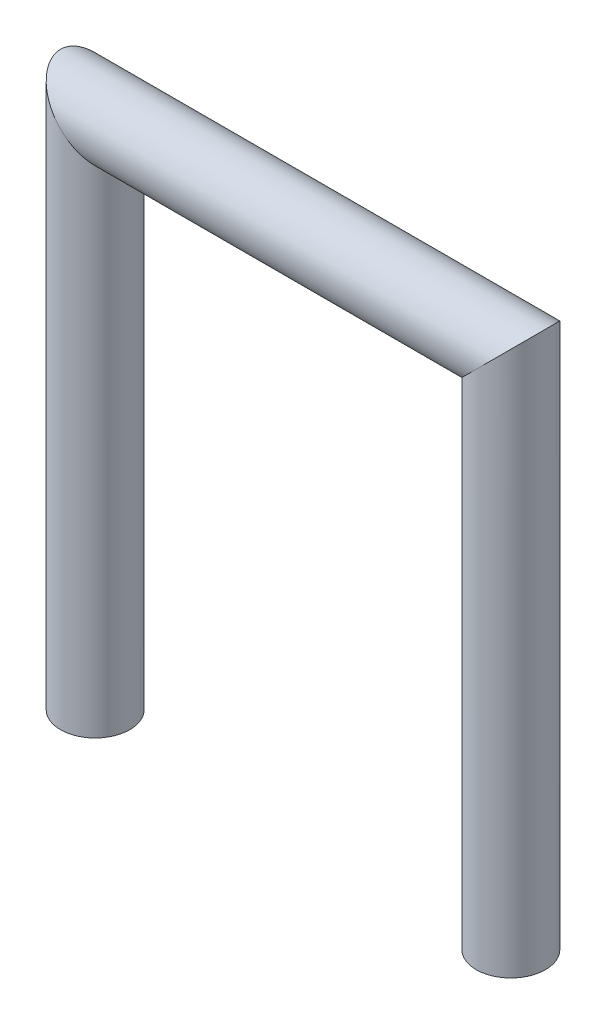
ISO-10303-21;
HEADER;
FILE_DESCRIPTION(('STEP AP214'),'2;1');
FILE_NAME('part.step','',(''),(''),'','','');
FILE_SCHEMA(('AUTOMOTIVE_DESIGN { 1 0 10303 214 1 1 1 1 }'));
ENDSEC;
DATA;
#1=APPLICATION_CONTEXT('core data for automotive mechanical design processes');
#2=APPLICATION_PROTOCOL_DEFINITION('international standard','automotive_design',2000,#1);
#3=PRODUCT_CONTEXT('',#1,'mechanical');
#4=PRODUCT('Part','Part','',(#3));
#5=PRODUCT_RELATED_PRODUCT_CATEGORY('part','',(#4));
#6=PRODUCT_DEFINITION_FORMATION('','',#4);
#7=PRODUCT_DEFINITION_CONTEXT('part definition',#1,'design');
#8=PRODUCT_DEFINITION('design','',#6,#7);
#9=PRODUCT_DEFINITION_SHAPE('','',#8);
#10=(LENGTH_UNIT() NAMED_UNIT(*) SI_UNIT(.MILLI.,.METRE.));
#11=(NAMED_UNIT(*) PLANE_ANGLE_UNIT() SI_UNIT($,.RADIAN.));
#12=(NAMED_UNIT(*) SI_UNIT($,.STERADIAN.) SOLID_ANGLE_UNIT());
#13=UNCERTAINTY_MEASURE_WITH_UNIT(LENGTH_MEASURE(1.E-05),#10,'distance_accuracy_value','');
#14=(GEOMETRIC_REPRESENTATION_CONTEXT(3) GLOBAL_UNCERTAINTY_ASSIGNED_CONTEXT((#13)) GLOBAL_UNIT_ASSIGNED_CONTEXT((#10,
#11,#12)) REPRESENTATION_CONTEXT('',''));
#15=CARTESIAN_POINT('',(0.,0.,0.));
#16=DIRECTION('',(0.,0.,1.));
#17=DIRECTION('',(1.,0.,0.));
#18=AXIS2_PLACEMENT_3D('',#15,#16,#17);
#19=CARTESIAN_POINT('',(0.,95.3309948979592,0.));
#20=DIRECTION('',(0.,-1.,0.));
#21=DIRECTION('',(0.,0.,-1.));
#22=AXIS2_PLACEMENT_3D('',#19,#20,#21);
#23=CYLINDRICAL_SURFACE('',#22,6.35);
#24=CARTESIAN_POINT('',(0.,95.3309948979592,0.));
#25=DIRECTION('',(-0.707106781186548,-0.707106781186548,0.));
#26=DIRECTION('',(-0.707106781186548,0.707106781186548,0.));
#27=AXIS2_PLACEMENT_3D('',#24,#25,#26);
#28=ELLIPSE('',#27,8.98025612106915,6.35);
#29=CARTESIAN_POINT('',(-6.35,101.680994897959,0.));
#30=VERTEX_POINT('',#29);
#31=EDGE_CURVE('E37',#30,#30,#28,.F.);
#32=ORIENTED_EDGE('',*,*,#31,.F.);
#33=EDGE_LOOP('',(#32));
#34=FACE_BOUND('',#33,.T.);
#35=CARTESIAN_POINT('',(0.,0.,0.));
#36=DIRECTION('',(0.,-1.,0.));
#37=DIRECTION('',(0.,0.,-1.));
#38=AXIS2_PLACEMENT_3D('',#35,#36,#37);
#39=CIRCLE('',#38,6.35);
#40=CARTESIAN_POINT('',(0.,0.,-6.35));
#41=VERTEX_POINT('',#40);
#42=EDGE_CURVE('E11',#41,#41,#39,.T.);
#43=ORIENTED_EDGE('',*,*,#42,.F.);
#44=EDGE_LOOP('',(#43));
#45=FACE_BOUND('',#44,.T.);
#46=ADVANCED_FACE('F31',(#34,#45),#23,.T.);
#47=CARTESIAN_POINT('',(76.2,95.3309948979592,0.));
#48=DIRECTION('',(-1.,0.,0.));
#49=DIRECTION('',(0.,0.,1.));
#50=AXIS2_PLACEMENT_3D('',#47,#48,#49);
#51=CYLINDRICAL_SURFACE('',#50,6.35);
#52=CARTESIAN_POINT('',(76.2,95.3309948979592,0.));
#53=DIRECTION('',(-0.707106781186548,0.707106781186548,0.));
#54=DIRECTION('',(-0.707106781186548,-0.707106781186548,0.));
#55=AXIS2_PLACEMENT_3D('',#52,#53,#54);
#56=ELLIPSE('',#55,8.98025612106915,6.35);
#57=CARTESIAN_POINT('',(69.85,88.9809948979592,0.));
#58=VERTEX_POINT('',#57);
#59=EDGE_CURVE('E41',#58,#58,#56,.T.);
#60=ORIENTED_EDGE('',*,*,#59,.T.);
#61=EDGE_LOOP('',(#60));
#62=FACE_BOUND('',#61,.T.);
#63=ORIENTED_EDGE('',*,*,#31,.T.);
#64=EDGE_LOOP('',(#63));
#65=FACE_BOUND('',#64,.T.);
#66=ADVANCED_FACE('F63',(#62,#65),#51,.T.);
#67=CARTESIAN_POINT('',(76.2,113.291507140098,0.));
#68=DIRECTION('',(0.,-1.,0.));
#69=DIRECTION('',(0.,0.,-1.));
#70=AXIS2_PLACEMENT_3D('',#67,#68,#69);
#71=CYLINDRICAL_SURFACE('',#70,6.35);
#72=CARTESIAN_POINT('',(76.2,0.,0.));
#73=DIRECTION('',(0.,1.,0.));
#74=DIRECTION('',(0.,0.,1.));
#75=AXIS2_PLACEMENT_3D('',#72,#73,#74);
#76=CIRCLE('',#75,6.35);
#77=CARTESIAN_POINT('',(76.2,0.,6.35));
#78=VERTEX_POINT('',#77);
#79=EDGE_CURVE('E45',#78,#78,#76,.T.);
#80=ORIENTED_EDGE('',*,*,#79,.T.);
#81=EDGE_LOOP('',(#80));
#82=FACE_BOUND('',#81,.T.);
#83=ORIENTED_EDGE('',*,*,#59,.F.);
#84=EDGE_LOOP('',(#83));
#85=FACE_BOUND('',#84,.T.);
#86=ADVANCED_FACE('F51',(#82,#85),#71,.T.);
#87=CARTESIAN_POINT('',(76.2,0.,0.));
#88=DIRECTION('',(0.,1.,0.));
#89=DIRECTION('',(0.,0.,1.));
#90=AXIS2_PLACEMENT_3D('',#87,#88,#89);
#91=PLANE('',#90);
#92=ORIENTED_EDGE('',*,*,#79,.F.);
#93=EDGE_LOOP('',(#92));
#94=FACE_BOUND('',#93,.T.);
#95=ADVANCED_FACE('F54',(#94),#91,.F.);
#96=CARTESIAN_POINT('',(0.,0.,0.));
#97=DIRECTION('',(0.,-1.,0.));
#98=DIRECTION('',(0.,0.,-1.));
#99=AXIS2_PLACEMENT_3D('',#96,#97,#98);
#100=PLANE('',#99);
#101=ORIENTED_EDGE('',*,*,#42,.T.);
#102=EDGE_LOOP('',(#101));
#103=FACE_BOUND('',#102,.T.);
#104=ADVANCED_FACE('F56',(#103),#100,.T.);
#105=CLOSED_SHELL('',(#46,#66,#86,#95,#104));
#106=MANIFOLD_SOLID_BREP('B2',#105);
#107=ADVANCED_BREP_SHAPE_REPRESENTATION('',(#18,#106),#14);
#108=SHAPE_DEFINITION_REPRESENTATION(#9,#107);
ENDSEC;
END-ISO-10303-21;
